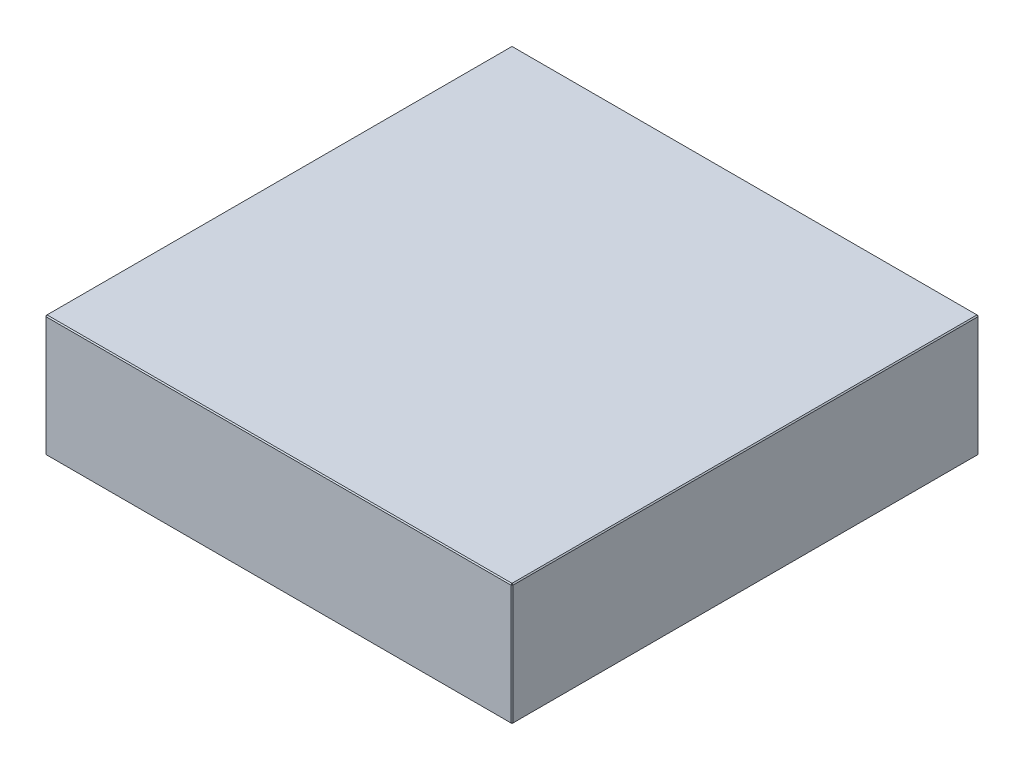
ISO-10303-21;
HEADER;
FILE_DESCRIPTION(('STEP AP214'),'2;1');
FILE_NAME('part.step','',(''),(''),'','','');
FILE_SCHEMA(('AUTOMOTIVE_DESIGN { 1 0 10303 214 1 1 1 1 }'));
ENDSEC;
DATA;
#1=APPLICATION_CONTEXT('core data for automotive mechanical design processes');
#2=APPLICATION_PROTOCOL_DEFINITION('international standard','automotive_design',2000,#1);
#3=PRODUCT_CONTEXT('',#1,'mechanical');
#4=PRODUCT('Part','Part','',(#3));
#5=PRODUCT_RELATED_PRODUCT_CATEGORY('part','',(#4));
#6=PRODUCT_DEFINITION_FORMATION('','',#4);
#7=PRODUCT_DEFINITION_CONTEXT('part definition',#1,'design');
#8=PRODUCT_DEFINITION('design','',#6,#7);
#9=PRODUCT_DEFINITION_SHAPE('','',#8);
#10=(LENGTH_UNIT() NAMED_UNIT(*) SI_UNIT(.MILLI.,.METRE.));
#11=(NAMED_UNIT(*) PLANE_ANGLE_UNIT() SI_UNIT($,.RADIAN.));
#12=(NAMED_UNIT(*) SI_UNIT($,.STERADIAN.) SOLID_ANGLE_UNIT());
#13=UNCERTAINTY_MEASURE_WITH_UNIT(LENGTH_MEASURE(1.E-05),#10,'distance_accuracy_value','');
#14=(GEOMETRIC_REPRESENTATION_CONTEXT(3) GLOBAL_UNCERTAINTY_ASSIGNED_CONTEXT((#13)) GLOBAL_UNIT_ASSIGNED_CONTEXT((#10,
#11,#12)) REPRESENTATION_CONTEXT('',''));
#15=CARTESIAN_POINT('',(0.,0.,0.));
#16=DIRECTION('',(0.,0.,1.));
#17=DIRECTION('',(1.,0.,0.));
#18=AXIS2_PLACEMENT_3D('',#15,#16,#17);
#19=CARTESIAN_POINT('',(-223.,116.,223.));
#20=DIRECTION('',(1.,0.,0.));
#21=DIRECTION('',(0.,0.,-1.));
#22=AXIS2_PLACEMENT_3D('',#19,#20,#21);
#23=PLANE('',#22);
#24=DIRECTION('',(0.,-1.,0.));
#25=VECTOR('',#24,1.);
#26=CARTESIAN_POINT('',(-223.,116.,-222.));
#27=LINE('',#26,#25);
#28=CARTESIAN_POINT('',(-223.,115.,-222.));
#29=VERTEX_POINT('',#28);
#30=CARTESIAN_POINT('',(-223.,0.999999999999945,-222.));
#31=VERTEX_POINT('',#30);
#32=EDGE_CURVE('E114',#29,#31,#27,.T.);
#33=ORIENTED_EDGE('',*,*,#32,.T.);
#34=DIRECTION('',(0.,0.,1.));
#35=VECTOR('',#34,1.);
#36=CARTESIAN_POINT('',(-223.,0.999999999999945,223.));
#37=LINE('',#36,#35);
#38=CARTESIAN_POINT('',(-223.,0.999999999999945,222.));
#39=VERTEX_POINT('',#38);
#40=EDGE_CURVE('E110',#31,#39,#37,.T.);
#41=ORIENTED_EDGE('',*,*,#40,.T.);
#42=DIRECTION('',(0.,1.,0.));
#43=VECTOR('',#42,1.);
#44=CARTESIAN_POINT('',(-223.,116.,222.));
#45=LINE('',#44,#43);
#46=CARTESIAN_POINT('',(-223.,115.,222.));
#47=VERTEX_POINT('',#46);
#48=EDGE_CURVE('E103',#39,#47,#45,.T.);
#49=ORIENTED_EDGE('',*,*,#48,.T.);
#50=DIRECTION('',(0.,0.,-1.));
#51=VECTOR('',#50,1.);
#52=CARTESIAN_POINT('',(-223.,115.,-223.));
#53=LINE('',#52,#51);
#54=EDGE_CURVE('E107',#47,#29,#53,.T.);
#55=ORIENTED_EDGE('',*,*,#54,.T.);
#56=EDGE_LOOP('',(#33,#41,#49,#55));
#57=FACE_BOUND('',#56,.T.);
#58=ADVANCED_FACE('F15',(#57),#23,.F.);
#59=CARTESIAN_POINT('',(223.,116.,223.));
#60=DIRECTION('',(0.,0.,-1.));
#61=DIRECTION('',(-1.,0.,0.));
#62=AXIS2_PLACEMENT_3D('',#59,#60,#61);
#63=PLANE('',#62);
#64=DIRECTION('',(-1.,0.,0.));
#65=VECTOR('',#64,1.);
#66=CARTESIAN_POINT('',(-223.,115.,223.));
#67=LINE('',#66,#65);
#68=CARTESIAN_POINT('',(222.,115.,223.));
#69=VERTEX_POINT('',#68);
#70=CARTESIAN_POINT('',(-222.,115.,223.));
#71=VERTEX_POINT('',#70);
#72=EDGE_CURVE('E164',#69,#71,#67,.T.);
#73=ORIENTED_EDGE('',*,*,#72,.T.);
#74=DIRECTION('',(0.,-1.,0.));
#75=VECTOR('',#74,1.);
#76=CARTESIAN_POINT('',(-222.,116.,223.));
#77=LINE('',#76,#75);
#78=CARTESIAN_POINT('',(-222.,0.999999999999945,223.));
#79=VERTEX_POINT('',#78);
#80=EDGE_CURVE('E122',#71,#79,#77,.T.);
#81=ORIENTED_EDGE('',*,*,#80,.T.);
#82=DIRECTION('',(1.,0.,0.));
#83=VECTOR('',#82,1.);
#84=CARTESIAN_POINT('',(223.,0.999999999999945,223.));
#85=LINE('',#84,#83);
#86=CARTESIAN_POINT('',(222.,0.999999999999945,223.));
#87=VERTEX_POINT('',#86);
#88=EDGE_CURVE('E168',#79,#87,#85,.T.);
#89=ORIENTED_EDGE('',*,*,#88,.T.);
#90=DIRECTION('',(0.,1.,0.));
#91=VECTOR('',#90,1.);
#92=CARTESIAN_POINT('',(222.,116.,223.));
#93=LINE('',#92,#91);
#94=EDGE_CURVE('E166',#87,#69,#93,.T.);
#95=ORIENTED_EDGE('',*,*,#94,.T.);
#96=EDGE_LOOP('',(#73,#81,#89,#95));
#97=FACE_BOUND('',#96,.T.);
#98=ADVANCED_FACE('F275',(#97),#63,.F.);
#99=CARTESIAN_POINT('',(223.,116.,223.));
#100=DIRECTION('',(-1.,0.,0.));
#101=DIRECTION('',(0.,0.,1.));
#102=AXIS2_PLACEMENT_3D('',#99,#100,#101);
#103=PLANE('',#102);
#104=DIRECTION('',(0.,0.,-1.));
#105=VECTOR('',#104,1.);
#106=CARTESIAN_POINT('',(223.,0.999999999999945,223.));
#107=LINE('',#106,#105);
#108=CARTESIAN_POINT('',(223.,0.999999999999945,222.));
#109=VERTEX_POINT('',#108);
#110=CARTESIAN_POINT('',(223.,0.999999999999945,-222.));
#111=VERTEX_POINT('',#110);
#112=EDGE_CURVE('E159',#109,#111,#107,.T.);
#113=ORIENTED_EDGE('',*,*,#112,.T.);
#114=DIRECTION('',(0.,1.,0.));
#115=VECTOR('',#114,1.);
#116=CARTESIAN_POINT('',(223.,116.,-222.));
#117=LINE('',#116,#115);
#118=CARTESIAN_POINT('',(223.,115.,-222.));
#119=VERTEX_POINT('',#118);
#120=EDGE_CURVE('E161',#111,#119,#117,.T.);
#121=ORIENTED_EDGE('',*,*,#120,.T.);
#122=DIRECTION('',(0.,0.,1.));
#123=VECTOR('',#122,1.);
#124=CARTESIAN_POINT('',(223.,115.,223.));
#125=LINE('',#124,#123);
#126=CARTESIAN_POINT('',(223.,115.,222.));
#127=VERTEX_POINT('',#126);
#128=EDGE_CURVE('E155',#119,#127,#125,.T.);
#129=ORIENTED_EDGE('',*,*,#128,.T.);
#130=DIRECTION('',(0.,-1.,0.));
#131=VECTOR('',#130,1.);
#132=CARTESIAN_POINT('',(223.,116.,222.));
#133=LINE('',#132,#131);
#134=EDGE_CURVE('E157',#127,#109,#133,.T.);
#135=ORIENTED_EDGE('',*,*,#134,.T.);
#136=EDGE_LOOP('',(#113,#121,#129,#135));
#137=FACE_BOUND('',#136,.T.);
#138=ADVANCED_FACE('F254',(#137),#103,.F.);
#139=CARTESIAN_POINT('',(223.,116.,-223.));
#140=DIRECTION('',(0.,0.,1.));
#141=DIRECTION('',(1.,0.,0.));
#142=AXIS2_PLACEMENT_3D('',#139,#140,#141);
#143=PLANE('',#142);
#144=DIRECTION('',(0.,-1.,0.));
#145=VECTOR('',#144,1.);
#146=CARTESIAN_POINT('',(222.,116.,-223.));
#147=LINE('',#146,#145);
#148=CARTESIAN_POINT('',(222.,115.,-223.));
#149=VERTEX_POINT('',#148);
#150=CARTESIAN_POINT('',(222.,0.999999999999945,-223.));
#151=VERTEX_POINT('',#150);
#152=EDGE_CURVE('E148',#149,#151,#147,.T.);
#153=ORIENTED_EDGE('',*,*,#152,.T.);
#154=DIRECTION('',(-1.,0.,0.));
#155=VECTOR('',#154,1.);
#156=CARTESIAN_POINT('',(223.,0.999999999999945,-223.));
#157=LINE('',#156,#155);
#158=CARTESIAN_POINT('',(-222.,0.999999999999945,-223.));
#159=VERTEX_POINT('',#158);
#160=EDGE_CURVE('E153',#151,#159,#157,.T.);
#161=ORIENTED_EDGE('',*,*,#160,.T.);
#162=DIRECTION('',(0.,1.,0.));
#163=VECTOR('',#162,1.);
#164=CARTESIAN_POINT('',(-222.,116.,-223.));
#165=LINE('',#164,#163);
#166=CARTESIAN_POINT('',(-222.,115.,-223.));
#167=VERTEX_POINT('',#166);
#168=EDGE_CURVE('E150',#159,#167,#165,.T.);
#169=ORIENTED_EDGE('',*,*,#168,.T.);
#170=DIRECTION('',(1.,0.,0.));
#171=VECTOR('',#170,1.);
#172=CARTESIAN_POINT('',(223.,115.,-223.));
#173=LINE('',#172,#171);
#174=EDGE_CURVE('E146',#167,#149,#173,.T.);
#175=ORIENTED_EDGE('',*,*,#174,.T.);
#176=EDGE_LOOP('',(#153,#161,#169,#175));
#177=FACE_BOUND('',#176,.T.);
#178=ADVANCED_FACE('F284',(#177),#143,.F.);
#179=CARTESIAN_POINT('',(0.,116.,0.));
#180=DIRECTION('',(0.,1.,0.));
#181=DIRECTION('',(0.,0.,1.));
#182=AXIS2_PLACEMENT_3D('',#179,#180,#181);
#183=PLANE('',#182);
#184=DIRECTION('',(0.,0.,-1.));
#185=VECTOR('',#184,1.);
#186=CARTESIAN_POINT('',(222.,116.,-223.));
#187=LINE('',#186,#185);
#188=CARTESIAN_POINT('',(222.,116.,222.));
#189=VERTEX_POINT('',#188);
#190=CARTESIAN_POINT('',(222.,116.,-222.));
#191=VERTEX_POINT('',#190);
#192=EDGE_CURVE('E24',#189,#191,#187,.T.);
#193=ORIENTED_EDGE('',*,*,#192,.T.);
#194=DIRECTION('',(-1.,0.,0.));
#195=VECTOR('',#194,1.);
#196=CARTESIAN_POINT('',(-223.,116.,-222.));
#197=LINE('',#196,#195);
#198=CARTESIAN_POINT('',(-222.,116.,-222.));
#199=VERTEX_POINT('',#198);
#200=EDGE_CURVE('E9',#191,#199,#197,.T.);
#201=ORIENTED_EDGE('',*,*,#200,.T.);
#202=DIRECTION('',(0.,0.,1.));
#203=VECTOR('',#202,1.);
#204=CARTESIAN_POINT('',(-222.,116.,223.));
#205=LINE('',#204,#203);
#206=CARTESIAN_POINT('',(-222.,116.,222.));
#207=VERTEX_POINT('',#206);
#208=EDGE_CURVE('E180',#199,#207,#205,.T.);
#209=ORIENTED_EDGE('',*,*,#208,.T.);
#210=DIRECTION('',(1.,0.,0.));
#211=VECTOR('',#210,1.);
#212=CARTESIAN_POINT('',(223.,116.,222.));
#213=LINE('',#212,#211);
#214=EDGE_CURVE('E35',#207,#189,#213,.T.);
#215=ORIENTED_EDGE('',*,*,#214,.T.);
#216=EDGE_LOOP('',(#193,#201,#209,#215));
#217=FACE_BOUND('',#216,.T.);
#218=ADVANCED_FACE('F350',(#217),#183,.T.);
#219=CARTESIAN_POINT('',(0.,0.,0.));
#220=DIRECTION('',(0.,1.,0.));
#221=DIRECTION('',(0.,0.,1.));
#222=AXIS2_PLACEMENT_3D('',#219,#220,#221);
#223=PLANE('',#222);
#224=DIRECTION('',(0.,0.,1.));
#225=VECTOR('',#224,1.);
#226=CARTESIAN_POINT('',(222.,0.,0.));
#227=LINE('',#226,#225);
#228=CARTESIAN_POINT('',(222.,0.,-222.));
#229=VERTEX_POINT('',#228);
#230=CARTESIAN_POINT('',(222.,0.,222.));
#231=VERTEX_POINT('',#230);
#232=EDGE_CURVE('E171',#229,#231,#227,.T.);
#233=ORIENTED_EDGE('',*,*,#232,.T.);
#234=DIRECTION('',(-1.,0.,0.));
#235=VECTOR('',#234,1.);
#236=CARTESIAN_POINT('',(0.,0.,222.));
#237=LINE('',#236,#235);
#238=CARTESIAN_POINT('',(-222.,0.,222.));
#239=VERTEX_POINT('',#238);
#240=EDGE_CURVE('E177',#231,#239,#237,.T.);
#241=ORIENTED_EDGE('',*,*,#240,.T.);
#242=DIRECTION('',(0.,0.,-1.));
#243=VECTOR('',#242,1.);
#244=CARTESIAN_POINT('',(-222.,0.,0.));
#245=LINE('',#244,#243);
#246=CARTESIAN_POINT('',(-222.,0.,-222.));
#247=VERTEX_POINT('',#246);
#248=EDGE_CURVE('E175',#239,#247,#245,.T.);
#249=ORIENTED_EDGE('',*,*,#248,.T.);
#250=DIRECTION('',(1.,0.,0.));
#251=VECTOR('',#250,1.);
#252=CARTESIAN_POINT('',(0.,0.,-222.));
#253=LINE('',#252,#251);
#254=EDGE_CURVE('E173',#247,#229,#253,.T.);
#255=ORIENTED_EDGE('',*,*,#254,.T.);
#256=EDGE_LOOP('',(#233,#241,#249,#255));
#257=FACE_BOUND('',#256,.T.);
#258=ADVANCED_FACE('F246',(#257),#223,.F.);
#259=CARTESIAN_POINT('',(223.,116.,222.));
#260=DIRECTION('',(-0.707106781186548,0.,-0.707106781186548));
#261=DIRECTION('',(0.,-1.,0.));
#262=AXIS2_PLACEMENT_3D('',#259,#260,#261);
#263=PLANE('',#262);
#264=DIRECTION('',(-0.707106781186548,0.,0.707106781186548));
#265=VECTOR('',#264,1.);
#266=CARTESIAN_POINT('',(222.,115.,223.));
#267=LINE('',#266,#265);
#268=EDGE_CURVE('E19',#69,#127,#267,.F.);
#269=ORIENTED_EDGE('',*,*,#268,.F.);
#270=ORIENTED_EDGE('',*,*,#94,.F.);
#271=DIRECTION('',(0.707106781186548,0.,-0.707106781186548));
#272=VECTOR('',#271,1.);
#273=CARTESIAN_POINT('',(222.,0.999999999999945,223.));
#274=LINE('',#273,#272);
#275=EDGE_CURVE('E142',#109,#87,#274,.F.);
#276=ORIENTED_EDGE('',*,*,#275,.F.);
#277=ORIENTED_EDGE('',*,*,#134,.F.);
#278=EDGE_LOOP('',(#269,#270,#276,#277));
#279=FACE_BOUND('',#278,.T.);
#280=ADVANCED_FACE('F17',(#279),#263,.F.);
#281=CARTESIAN_POINT('',(222.,115.,223.));
#282=DIRECTION('',(0.577350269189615,0.577350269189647,0.577350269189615));
#283=DIRECTION('',(0.,-0.707106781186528,0.707106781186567));
#284=AXIS2_PLACEMENT_3D('',#281,#282,#283);
#285=PLANE('',#284);
#286=DIRECTION('',(0.,-0.707106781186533,0.707106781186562));
#287=VECTOR('',#286,1.);
#288=CARTESIAN_POINT('',(222.,115.,223.));
#289=LINE('',#288,#287);
#290=EDGE_CURVE('E226',#69,#189,#289,.F.);
#291=ORIENTED_EDGE('',*,*,#290,.F.);
#292=ORIENTED_EDGE('',*,*,#268,.T.);
#293=DIRECTION('',(-0.707106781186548,0.707106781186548,0.));
#294=VECTOR('',#293,1.);
#295=CARTESIAN_POINT('',(222.5,115.5,222.));
#296=LINE('',#295,#294);
#297=EDGE_CURVE('E228',#189,#127,#296,.F.);
#298=ORIENTED_EDGE('',*,*,#297,.F.);
#299=EDGE_LOOP('',(#291,#292,#298));
#300=FACE_BOUND('',#299,.T.);
#301=ADVANCED_FACE('F270',(#300),#285,.T.);
#302=CARTESIAN_POINT('',(222.,0.999999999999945,223.));
#303=DIRECTION('',(0.57735026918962,-0.577350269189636,0.57735026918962));
#304=DIRECTION('',(0.,-0.707106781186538,-0.707106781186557));
#305=AXIS2_PLACEMENT_3D('',#302,#303,#304);
#306=PLANE('',#305);
#307=DIRECTION('',(-0.707106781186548,-0.707106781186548,0.));
#308=VECTOR('',#307,1.);
#309=CARTESIAN_POINT('',(222.5,0.499999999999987,222.));
#310=LINE('',#309,#308);
#311=EDGE_CURVE('E220',#109,#231,#310,.T.);
#312=ORIENTED_EDGE('',*,*,#311,.F.);
#313=ORIENTED_EDGE('',*,*,#275,.T.);
#314=DIRECTION('',(0.,0.707106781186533,0.707106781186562));
#315=VECTOR('',#314,1.);
#316=CARTESIAN_POINT('',(222.,0.999999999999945,223.));
#317=LINE('',#316,#315);
#318=EDGE_CURVE('E223',#231,#87,#317,.T.);
#319=ORIENTED_EDGE('',*,*,#318,.F.);
#320=EDGE_LOOP('',(#312,#313,#319));
#321=FACE_BOUND('',#320,.T.);
#322=ADVANCED_FACE('F235',(#321),#306,.T.);
#323=CARTESIAN_POINT('',(222.,116.,0.));
#324=DIRECTION('',(0.707106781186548,0.707106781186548,0.));
#325=DIRECTION('',(0.,0.,1.));
#326=AXIS2_PLACEMENT_3D('',#323,#324,#325);
#327=PLANE('',#326);
#328=ORIENTED_EDGE('',*,*,#297,.T.);
#329=ORIENTED_EDGE('',*,*,#128,.F.);
#330=DIRECTION('',(0.707106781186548,-0.707106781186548,0.));
#331=VECTOR('',#330,1.);
#332=CARTESIAN_POINT('',(223.,115.,-222.));
#333=LINE('',#332,#331);
#334=EDGE_CURVE('E215',#191,#119,#333,.T.);
#335=ORIENTED_EDGE('',*,*,#334,.F.);
#336=ORIENTED_EDGE('',*,*,#192,.F.);
#337=EDGE_LOOP('',(#328,#329,#335,#336));
#338=FACE_BOUND('',#337,.T.);
#339=ADVANCED_FACE('F265',(#338),#327,.T.);
#340=CARTESIAN_POINT('',(0.,116.,222.));
#341=DIRECTION('',(0.,0.707106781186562,0.707106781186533));
#342=DIRECTION('',(-1.,0.,0.));
#343=AXIS2_PLACEMENT_3D('',#340,#341,#342);
#344=PLANE('',#343);
#345=ORIENTED_EDGE('',*,*,#290,.T.);
#346=ORIENTED_EDGE('',*,*,#214,.F.);
#347=DIRECTION('',(0.,0.707106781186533,-0.707106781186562));
#348=VECTOR('',#347,1.);
#349=CARTESIAN_POINT('',(-222.,115.5,222.5));
#350=LINE('',#349,#348);
#351=EDGE_CURVE('E126',#71,#207,#350,.T.);
#352=ORIENTED_EDGE('',*,*,#351,.F.);
#353=ORIENTED_EDGE('',*,*,#72,.F.);
#354=EDGE_LOOP('',(#345,#346,#352,#353));
#355=FACE_BOUND('',#354,.T.);
#356=ADVANCED_FACE('F273',(#355),#344,.T.);
#357=CARTESIAN_POINT('',(-222.,116.,223.));
#358=DIRECTION('',(0.707106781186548,0.,-0.707106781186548));
#359=DIRECTION('',(0.,-1.,0.));
#360=AXIS2_PLACEMENT_3D('',#357,#358,#359);
#361=PLANE('',#360);
#362=DIRECTION('',(0.707106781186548,0.,0.707106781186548));
#363=VECTOR('',#362,1.);
#364=CARTESIAN_POINT('',(-222.,0.999999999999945,223.));
#365=LINE('',#364,#363);
#366=EDGE_CURVE('E127',#79,#39,#365,.F.);
#367=ORIENTED_EDGE('',*,*,#366,.F.);
#368=ORIENTED_EDGE('',*,*,#80,.F.);
#369=DIRECTION('',(-0.707106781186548,0.,-0.707106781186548));
#370=VECTOR('',#369,1.);
#371=CARTESIAN_POINT('',(-223.,115.,222.));
#372=LINE('',#371,#370);
#373=EDGE_CURVE('E118',#47,#71,#372,.F.);
#374=ORIENTED_EDGE('',*,*,#373,.F.);
#375=ORIENTED_EDGE('',*,*,#48,.F.);
#376=EDGE_LOOP('',(#367,#368,#374,#375));
#377=FACE_BOUND('',#376,.T.);
#378=ADVANCED_FACE('F120',(#377),#361,.F.);
#379=CARTESIAN_POINT('',(223.,0.999999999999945,223.));
#380=DIRECTION('',(0.,0.707106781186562,-0.707106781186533));
#381=DIRECTION('',(1.,0.,0.));
#382=AXIS2_PLACEMENT_3D('',#379,#380,#381);
#383=PLANE('',#382);
#384=ORIENTED_EDGE('',*,*,#318,.T.);
#385=ORIENTED_EDGE('',*,*,#88,.F.);
#386=DIRECTION('',(0.,-0.707106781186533,-0.707106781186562));
#387=VECTOR('',#386,1.);
#388=CARTESIAN_POINT('',(-222.,0.999999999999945,223.));
#389=LINE('',#388,#387);
#390=EDGE_CURVE('E211',#239,#79,#389,.F.);
#391=ORIENTED_EDGE('',*,*,#390,.F.);
#392=ORIENTED_EDGE('',*,*,#240,.F.);
#393=EDGE_LOOP('',(#384,#385,#391,#392));
#394=FACE_BOUND('',#393,.T.);
#395=ADVANCED_FACE('F243',(#394),#383,.F.);
#396=CARTESIAN_POINT('',(223.,0.999999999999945,223.));
#397=DIRECTION('',(-0.707106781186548,0.707106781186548,0.));
#398=DIRECTION('',(0.,0.,-1.));
#399=AXIS2_PLACEMENT_3D('',#396,#397,#398);
#400=PLANE('',#399);
#401=ORIENTED_EDGE('',*,*,#311,.T.);
#402=ORIENTED_EDGE('',*,*,#232,.F.);
#403=DIRECTION('',(0.707106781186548,0.707106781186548,0.));
#404=VECTOR('',#403,1.);
#405=CARTESIAN_POINT('',(222.5,0.499999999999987,-222.));
#406=LINE('',#405,#404);
#407=EDGE_CURVE('E208',#111,#229,#406,.F.);
#408=ORIENTED_EDGE('',*,*,#407,.F.);
#409=ORIENTED_EDGE('',*,*,#112,.F.);
#410=EDGE_LOOP('',(#401,#402,#408,#409));
#411=FACE_BOUND('',#410,.T.);
#412=ADVANCED_FACE('F251',(#411),#400,.F.);
#413=CARTESIAN_POINT('',(222.,116.,-223.));
#414=DIRECTION('',(-0.707106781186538,0.,0.707106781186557));
#415=DIRECTION('',(0.,-1.,0.));
#416=AXIS2_PLACEMENT_3D('',#413,#414,#415);
#417=PLANE('',#416);
#418=DIRECTION('',(0.707106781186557,0.,0.707106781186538));
#419=VECTOR('',#418,1.);
#420=CARTESIAN_POINT('',(223.,115.,-222.));
#421=LINE('',#420,#419);
#422=EDGE_CURVE('E217',#119,#149,#421,.F.);
#423=ORIENTED_EDGE('',*,*,#422,.F.);
#424=ORIENTED_EDGE('',*,*,#120,.F.);
#425=DIRECTION('',(-0.707106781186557,0.,-0.707106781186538));
#426=VECTOR('',#425,1.);
#427=CARTESIAN_POINT('',(222.,0.999999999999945,-223.));
#428=LINE('',#427,#426);
#429=EDGE_CURVE('E205',#151,#111,#428,.F.);
#430=ORIENTED_EDGE('',*,*,#429,.F.);
#431=ORIENTED_EDGE('',*,*,#152,.F.);
#432=EDGE_LOOP('',(#423,#424,#430,#431));
#433=FACE_BOUND('',#432,.T.);
#434=ADVANCED_FACE('F258',(#433),#417,.F.);
#435=CARTESIAN_POINT('',(223.,115.,-222.));
#436=DIRECTION('',(0.577350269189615,0.577350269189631,-0.577350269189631));
#437=DIRECTION('',(0.,0.707106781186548,0.707106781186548));
#438=AXIS2_PLACEMENT_3D('',#435,#436,#437);
#439=PLANE('',#438);
#440=ORIENTED_EDGE('',*,*,#334,.T.);
#441=ORIENTED_EDGE('',*,*,#422,.T.);
#442=DIRECTION('',(0.,0.707106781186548,0.707106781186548));
#443=VECTOR('',#442,1.);
#444=CARTESIAN_POINT('',(222.,115.5,-222.5));
#445=LINE('',#444,#443);
#446=EDGE_CURVE('E134',#191,#149,#445,.F.);
#447=ORIENTED_EDGE('',*,*,#446,.F.);
#448=EDGE_LOOP('',(#440,#441,#447));
#449=FACE_BOUND('',#448,.T.);
#450=ADVANCED_FACE('F325',(#449),#439,.T.);
#451=CARTESIAN_POINT('',(-223.,115.,222.));
#452=DIRECTION('',(-0.577350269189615,0.577350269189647,0.577350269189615));
#453=DIRECTION('',(0.,-0.707106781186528,0.707106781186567));
#454=AXIS2_PLACEMENT_3D('',#451,#452,#453);
#455=PLANE('',#454);
#456=ORIENTED_EDGE('',*,*,#373,.T.);
#457=ORIENTED_EDGE('',*,*,#351,.T.);
#458=DIRECTION('',(-0.707106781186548,-0.707106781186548,0.));
#459=VECTOR('',#458,1.);
#460=CARTESIAN_POINT('',(-223.,115.,222.));
#461=LINE('',#460,#459);
#462=EDGE_CURVE('E130',#47,#207,#461,.F.);
#463=ORIENTED_EDGE('',*,*,#462,.F.);
#464=EDGE_LOOP('',(#456,#457,#463));
#465=FACE_BOUND('',#464,.T.);
#466=ADVANCED_FACE('F131',(#465),#455,.T.);
#467=CARTESIAN_POINT('',(-222.,0.999999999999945,223.));
#468=DIRECTION('',(-0.57735026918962,-0.577350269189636,0.57735026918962));
#469=DIRECTION('',(0.,-0.707106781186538,-0.707106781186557));
#470=AXIS2_PLACEMENT_3D('',#467,#468,#469);
#471=PLANE('',#470);
#472=ORIENTED_EDGE('',*,*,#390,.T.);
#473=ORIENTED_EDGE('',*,*,#366,.T.);
#474=DIRECTION('',(-0.707106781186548,0.707106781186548,0.));
#475=VECTOR('',#474,1.);
#476=CARTESIAN_POINT('',(-222.5,0.499999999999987,222.));
#477=LINE('',#476,#475);
#478=EDGE_CURVE('E135',#239,#39,#477,.T.);
#479=ORIENTED_EDGE('',*,*,#478,.F.);
#480=EDGE_LOOP('',(#472,#473,#479));
#481=FACE_BOUND('',#480,.T.);
#482=ADVANCED_FACE('F318',(#481),#471,.T.);
#483=CARTESIAN_POINT('',(222.,0.999999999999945,-223.));
#484=DIRECTION('',(0.577350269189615,-0.577350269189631,-0.577350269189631));
#485=DIRECTION('',(0.,0.707106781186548,-0.707106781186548));
#486=AXIS2_PLACEMENT_3D('',#483,#484,#485);
#487=PLANE('',#486);
#488=ORIENTED_EDGE('',*,*,#429,.T.);
#489=ORIENTED_EDGE('',*,*,#407,.T.);
#490=DIRECTION('',(0.,-0.707106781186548,0.707106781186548));
#491=VECTOR('',#490,1.);
#492=CARTESIAN_POINT('',(222.,0.999999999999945,-223.));
#493=LINE('',#492,#491);
#494=EDGE_CURVE('E198',#151,#229,#493,.T.);
#495=ORIENTED_EDGE('',*,*,#494,.F.);
#496=EDGE_LOOP('',(#488,#489,#495));
#497=FACE_BOUND('',#496,.T.);
#498=ADVANCED_FACE('F314',(#497),#487,.T.);
#499=CARTESIAN_POINT('',(0.,116.,-222.));
#500=DIRECTION('',(0.,0.707106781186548,-0.707106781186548));
#501=DIRECTION('',(1.,0.,0.));
#502=AXIS2_PLACEMENT_3D('',#499,#500,#501);
#503=PLANE('',#502);
#504=ORIENTED_EDGE('',*,*,#446,.T.);
#505=ORIENTED_EDGE('',*,*,#174,.F.);
#506=DIRECTION('',(0.,-0.707106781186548,-0.707106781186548));
#507=VECTOR('',#506,1.);
#508=CARTESIAN_POINT('',(-222.,115.,-223.));
#509=LINE('',#508,#507);
#510=EDGE_CURVE('E195',#199,#167,#509,.T.);
#511=ORIENTED_EDGE('',*,*,#510,.F.);
#512=ORIENTED_EDGE('',*,*,#200,.F.);
#513=EDGE_LOOP('',(#504,#505,#511,#512));
#514=FACE_BOUND('',#513,.T.);
#515=ADVANCED_FACE('F311',(#514),#503,.T.);
#516=CARTESIAN_POINT('',(-222.,116.,0.));
#517=DIRECTION('',(-0.707106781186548,0.707106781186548,0.));
#518=DIRECTION('',(0.,0.,-1.));
#519=AXIS2_PLACEMENT_3D('',#516,#517,#518);
#520=PLANE('',#519);
#521=ORIENTED_EDGE('',*,*,#462,.T.);
#522=ORIENTED_EDGE('',*,*,#208,.F.);
#523=DIRECTION('',(0.707106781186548,0.707106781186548,0.));
#524=VECTOR('',#523,1.);
#525=CARTESIAN_POINT('',(-222.5,115.5,-222.));
#526=LINE('',#525,#524);
#527=EDGE_CURVE('E138',#29,#199,#526,.T.);
#528=ORIENTED_EDGE('',*,*,#527,.F.);
#529=ORIENTED_EDGE('',*,*,#54,.F.);
#530=EDGE_LOOP('',(#521,#522,#528,#529));
#531=FACE_BOUND('',#530,.T.);
#532=ADVANCED_FACE('F137',(#531),#520,.T.);
#533=CARTESIAN_POINT('',(-223.,0.999999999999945,223.));
#534=DIRECTION('',(0.707106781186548,0.707106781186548,0.));
#535=DIRECTION('',(0.,0.,1.));
#536=AXIS2_PLACEMENT_3D('',#533,#534,#535);
#537=PLANE('',#536);
#538=ORIENTED_EDGE('',*,*,#478,.T.);
#539=ORIENTED_EDGE('',*,*,#40,.F.);
#540=DIRECTION('',(0.707106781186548,-0.707106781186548,0.));
#541=VECTOR('',#540,1.);
#542=CARTESIAN_POINT('',(-223.,0.999999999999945,-222.));
#543=LINE('',#542,#541);
#544=EDGE_CURVE('E191',#247,#31,#543,.F.);
#545=ORIENTED_EDGE('',*,*,#544,.F.);
#546=ORIENTED_EDGE('',*,*,#248,.F.);
#547=EDGE_LOOP('',(#538,#539,#545,#546));
#548=FACE_BOUND('',#547,.T.);
#549=ADVANCED_FACE('F304',(#548),#537,.F.);
#550=CARTESIAN_POINT('',(223.,0.999999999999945,-223.));
#551=DIRECTION('',(0.,0.707106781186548,0.707106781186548));
#552=DIRECTION('',(-1.,0.,0.));
#553=AXIS2_PLACEMENT_3D('',#550,#551,#552);
#554=PLANE('',#553);
#555=ORIENTED_EDGE('',*,*,#494,.T.);
#556=ORIENTED_EDGE('',*,*,#254,.F.);
#557=DIRECTION('',(0.,0.707106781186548,-0.707106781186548));
#558=VECTOR('',#557,1.);
#559=CARTESIAN_POINT('',(-222.,0.499999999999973,-222.5));
#560=LINE('',#559,#558);
#561=EDGE_CURVE('E188',#159,#247,#560,.F.);
#562=ORIENTED_EDGE('',*,*,#561,.F.);
#563=ORIENTED_EDGE('',*,*,#160,.F.);
#564=EDGE_LOOP('',(#555,#556,#562,#563));
#565=FACE_BOUND('',#564,.T.);
#566=ADVANCED_FACE('F300',(#565),#554,.F.);
#567=CARTESIAN_POINT('',(-222.,115.,-223.));
#568=DIRECTION('',(-0.577350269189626,0.577350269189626,-0.577350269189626));
#569=DIRECTION('',(-0.707106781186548,0.,0.707106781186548));
#570=AXIS2_PLACEMENT_3D('',#567,#568,#569);
#571=PLANE('',#570);
#572=ORIENTED_EDGE('',*,*,#527,.T.);
#573=ORIENTED_EDGE('',*,*,#510,.T.);
#574=DIRECTION('',(0.707106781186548,0.,-0.707106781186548));
#575=VECTOR('',#574,1.);
#576=CARTESIAN_POINT('',(-222.,115.,-223.));
#577=LINE('',#576,#575);
#578=EDGE_CURVE('E186',#29,#167,#577,.T.);
#579=ORIENTED_EDGE('',*,*,#578,.F.);
#580=EDGE_LOOP('',(#572,#573,#579));
#581=FACE_BOUND('',#580,.T.);
#582=ADVANCED_FACE('F296',(#581),#571,.T.);
#583=CARTESIAN_POINT('',(-223.,0.999999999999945,-222.));
#584=DIRECTION('',(-0.577350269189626,-0.577350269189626,-0.577350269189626));
#585=DIRECTION('',(-0.707106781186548,0.,0.707106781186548));
#586=AXIS2_PLACEMENT_3D('',#583,#584,#585);
#587=PLANE('',#586);
#588=ORIENTED_EDGE('',*,*,#561,.T.);
#589=ORIENTED_EDGE('',*,*,#544,.T.);
#590=DIRECTION('',(-0.707106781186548,0.,0.707106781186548));
#591=VECTOR('',#590,1.);
#592=CARTESIAN_POINT('',(-223.,0.999999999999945,-222.));
#593=LINE('',#592,#591);
#594=EDGE_CURVE('E184',#159,#31,#593,.T.);
#595=ORIENTED_EDGE('',*,*,#594,.F.);
#596=EDGE_LOOP('',(#588,#589,#595));
#597=FACE_BOUND('',#596,.T.);
#598=ADVANCED_FACE('F292',(#597),#587,.T.);
#599=CARTESIAN_POINT('',(-223.,116.,-222.));
#600=DIRECTION('',(0.707106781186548,0.,0.707106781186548));
#601=DIRECTION('',(0.,-1.,0.));
#602=AXIS2_PLACEMENT_3D('',#599,#600,#601);
#603=PLANE('',#602);
#604=ORIENTED_EDGE('',*,*,#578,.T.);
#605=ORIENTED_EDGE('',*,*,#168,.F.);
#606=ORIENTED_EDGE('',*,*,#594,.T.);
#607=ORIENTED_EDGE('',*,*,#32,.F.);
#608=EDGE_LOOP('',(#604,#605,#606,#607));
#609=FACE_BOUND('',#608,.T.);
#610=ADVANCED_FACE('F289',(#609),#603,.F.);
#611=CLOSED_SHELL('',(#58,#98,#138,#178,#218,#258,#280,#301,#322,#339,#356,#378,#395,#412,#434,
#450,#466,#482,#498,#515,#532,#549,#566,#582,#598,#610));
#612=MANIFOLD_SOLID_BREP('B1',#611);
#613=ADVANCED_BREP_SHAPE_REPRESENTATION('',(#18,#612),#14);
#614=SHAPE_DEFINITION_REPRESENTATION(#9,#613);
ENDSEC;
END-ISO-10303-21;
